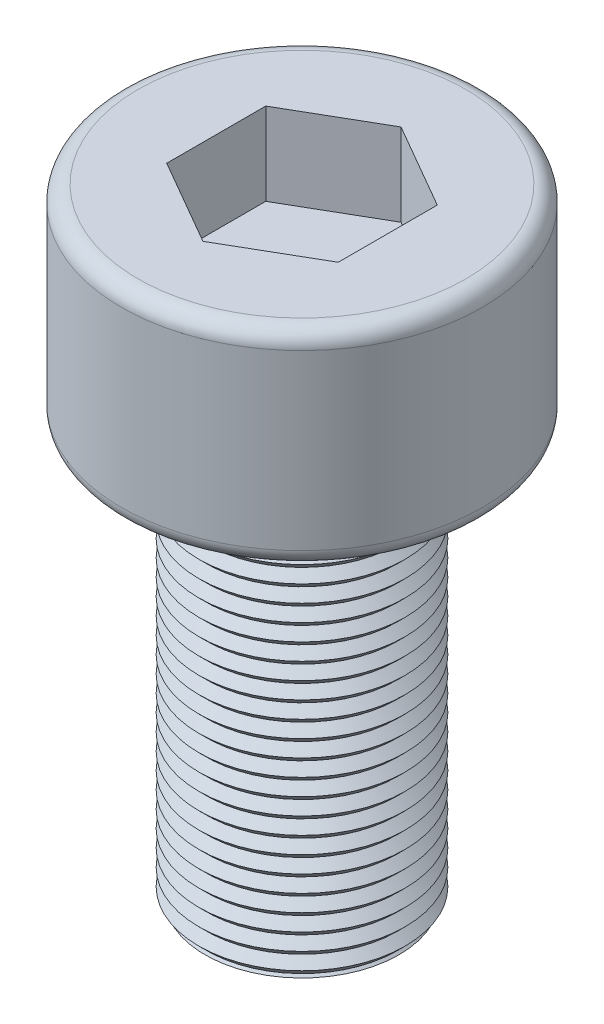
ISO-10303-21;
HEADER;
FILE_DESCRIPTION(('STEP AP214'),'2;1');
FILE_NAME('part.step','',(''),(''),'','','');
FILE_SCHEMA(('AUTOMOTIVE_DESIGN { 1 0 10303 214 1 1 1 1 }'));
ENDSEC;
DATA;
#1=APPLICATION_CONTEXT('core data for automotive mechanical design processes');
#2=APPLICATION_PROTOCOL_DEFINITION('international standard','automotive_design',2000,#1);
#3=PRODUCT_CONTEXT('',#1,'mechanical');
#4=PRODUCT('Part','Part','',(#3));
#5=PRODUCT_RELATED_PRODUCT_CATEGORY('part','',(#4));
#6=PRODUCT_DEFINITION_FORMATION('','',#4);
#7=PRODUCT_DEFINITION_CONTEXT('part definition',#1,'design');
#8=PRODUCT_DEFINITION('design','',#6,#7);
#9=PRODUCT_DEFINITION_SHAPE('','',#8);
#10=(LENGTH_UNIT() NAMED_UNIT(*) SI_UNIT(.MILLI.,.METRE.));
#11=(NAMED_UNIT(*) PLANE_ANGLE_UNIT() SI_UNIT($,.RADIAN.));
#12=(NAMED_UNIT(*) SI_UNIT($,.STERADIAN.) SOLID_ANGLE_UNIT());
#13=UNCERTAINTY_MEASURE_WITH_UNIT(LENGTH_MEASURE(1.E-05),#10,'distance_accuracy_value','');
#14=(GEOMETRIC_REPRESENTATION_CONTEXT(3) GLOBAL_UNCERTAINTY_ASSIGNED_CONTEXT((#13)) GLOBAL_UNIT_ASSIGNED_CONTEXT((#10,
#11,#12)) REPRESENTATION_CONTEXT('',''));
#15=CARTESIAN_POINT('',(0.,0.,0.));
#16=DIRECTION('',(0.,0.,1.));
#17=DIRECTION('',(1.,0.,0.));
#18=AXIS2_PLACEMENT_3D('',#15,#16,#17);
#19=CARTESIAN_POINT('',(-1.7812797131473E-12,-0.0944588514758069,0.));
#20=DIRECTION('',(-1.85174994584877E-13,-1.,0.));
#21=DIRECTION('',(1.,-1.85174994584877E-13,0.));
#22=AXIS2_PLACEMENT_3D('',#19,#20,#21);
#23=CONICAL_SURFACE('',#22,1.58749682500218,0.785398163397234);
#24=CARTESIAN_POINT('',(-1.75741270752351E-12,0.0344300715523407,0.));
#25=DIRECTION('',(1.85174994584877E-13,1.,0.));
#26=DIRECTION('',(-1.,1.85174994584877E-13,0.));
#27=AXIS2_PLACEMENT_3D('',#24,#25,#26);
#28=CIRCLE('',#27,1.45860790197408);
#29=CARTESIAN_POINT('',(-1.45860790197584,0.0344300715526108,0.));
#30=VERTEX_POINT('',#29);
#31=EDGE_CURVE('E140',#30,#30,#28,.T.);
#32=ORIENTED_EDGE('',*,*,#31,.F.);
#33=EDGE_LOOP('',(#32));
#34=FACE_BOUND('',#33,.T.);
#35=CARTESIAN_POINT('',(-1.76379064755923E-12,-1.2700000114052E-05,0.));
#36=DIRECTION('',(-1.85174994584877E-13,-1.,0.));
#37=DIRECTION('',(1.,-1.85174994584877E-13,0.));
#38=AXIS2_PLACEMENT_3D('',#35,#36,#37);
#39=CIRCLE('',#38,1.49305067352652);
#40=CARTESIAN_POINT('',(1.49305067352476,-1.27000003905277E-05,0.));
#41=VERTEX_POINT('',#40);
#42=EDGE_CURVE('E41',#41,#41,#39,.T.);
#43=ORIENTED_EDGE('',*,*,#42,.F.);
#44=EDGE_LOOP('',(#43));
#45=FACE_BOUND('',#44,.T.);
#46=ADVANCED_FACE('F37',(#34,#45),#23,.T.);
#47=CARTESIAN_POINT('',(0.,9.52498094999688,0.));
#48=DIRECTION('',(-1.85174994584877E-13,-1.,0.));
#49=DIRECTION('',(1.,-1.85174994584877E-13,0.));
#50=AXIS2_PLACEMENT_3D('',#47,#48,#49);
#51=PLANE('',#50);
#52=CARTESIAN_POINT('',(0.,9.52498094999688,0.));
#53=DIRECTION('',(-1.85174994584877E-13,-1.,0.));
#54=DIRECTION('',(1.,-1.85174994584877E-13,0.));
#55=AXIS2_PLACEMENT_3D('',#52,#53,#54);
#56=CIRCLE('',#55,2.5241194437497);
#57=CARTESIAN_POINT('',(2.5241194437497,9.52498094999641,0.));
#58=VERTEX_POINT('',#57);
#59=EDGE_CURVE('E11',#58,#58,#56,.F.);
#60=ORIENTED_EDGE('',*,*,#59,.T.);
#61=EDGE_LOOP('',(#60));
#62=FACE_BOUND('',#61,.T.);
#63=DIRECTION('',(-0.866025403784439,0.,0.5));
#64=VECTOR('',#63,1.);
#65=CARTESIAN_POINT('',(0.,9.52498094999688,-1.524));
#66=LINE('',#65,#64);
#67=CARTESIAN_POINT('',(0.,9.52498094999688,-1.524));
#68=VERTEX_POINT('',#67);
#69=CARTESIAN_POINT('',(-1.31982271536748,9.52498094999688,-0.762));
#70=VERTEX_POINT('',#69);
#71=EDGE_CURVE('E127',#68,#70,#66,.T.);
#72=ORIENTED_EDGE('',*,*,#71,.F.);
#73=DIRECTION('',(-0.866025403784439,0.,-0.5));
#74=VECTOR('',#73,1.);
#75=CARTESIAN_POINT('',(1.31982271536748,9.52498094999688,-0.762));
#76=LINE('',#75,#74);
#77=CARTESIAN_POINT('',(1.31982271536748,9.52498094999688,-0.762));
#78=VERTEX_POINT('',#77);
#79=EDGE_CURVE('E53',#78,#68,#76,.T.);
#80=ORIENTED_EDGE('',*,*,#79,.F.);
#81=DIRECTION('',(0.,0.,-1.));
#82=VECTOR('',#81,1.);
#83=CARTESIAN_POINT('',(1.31982271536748,9.52498094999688,0.762));
#84=LINE('',#83,#82);
#85=CARTESIAN_POINT('',(1.31982271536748,9.52498094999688,0.762));
#86=VERTEX_POINT('',#85);
#87=EDGE_CURVE('E136',#86,#78,#84,.T.);
#88=ORIENTED_EDGE('',*,*,#87,.F.);
#89=DIRECTION('',(0.866025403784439,0.,-0.5));
#90=VECTOR('',#89,1.);
#91=CARTESIAN_POINT('',(0.,9.52498094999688,1.524));
#92=LINE('',#91,#90);
#93=CARTESIAN_POINT('',(0.,9.52498094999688,1.524));
#94=VERTEX_POINT('',#93);
#95=EDGE_CURVE('E134',#94,#86,#92,.T.);
#96=ORIENTED_EDGE('',*,*,#95,.F.);
#97=DIRECTION('',(0.866025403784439,0.,0.5));
#98=VECTOR('',#97,1.);
#99=CARTESIAN_POINT('',(-1.31982271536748,9.52498094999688,0.762));
#100=LINE('',#99,#98);
#101=CARTESIAN_POINT('',(-1.31982271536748,9.52498094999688,0.762));
#102=VERTEX_POINT('',#101);
#103=EDGE_CURVE('E101',#102,#94,#100,.T.);
#104=ORIENTED_EDGE('',*,*,#103,.F.);
#105=DIRECTION('',(0.,0.,1.));
#106=VECTOR('',#105,1.);
#107=CARTESIAN_POINT('',(-1.31982271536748,9.52498094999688,-0.762));
#108=LINE('',#107,#106);
#109=EDGE_CURVE('E130',#70,#102,#108,.T.);
#110=ORIENTED_EDGE('',*,*,#109,.F.);
#111=EDGE_LOOP('',(#72,#80,#88,#96,#104,#110));
#112=FACE_BOUND('',#111,.T.);
#113=ADVANCED_FACE('F315',(#62,#112),#51,.F.);
#114=CARTESIAN_POINT('',(0.,9.52498094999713,0.));
#115=DIRECTION('',(1.85174994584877E-13,1.,0.));
#116=DIRECTION('',(-1.,1.85174994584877E-13,0.));
#117=AXIS2_PLACEMENT_3D('',#114,#115,#116);
#118=CYLINDRICAL_SURFACE('',#117,2.7781194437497);
#119=CARTESIAN_POINT('',(-5.40894983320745E-13,6.60398729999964,0.));
#120=DIRECTION('',(1.85174994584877E-13,1.,0.));
#121=DIRECTION('',(-1.,1.85174994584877E-13,0.));
#122=AXIS2_PLACEMENT_3D('',#119,#120,#121);
#123=CIRCLE('',#122,2.7781194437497);
#124=CARTESIAN_POINT('',(-2.77811944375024,6.60398730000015,0.));
#125=VERTEX_POINT('',#124);
#126=EDGE_CURVE('E298',#125,#125,#123,.T.);
#127=ORIENTED_EDGE('',*,*,#126,.T.);
#128=EDGE_LOOP('',(#127));
#129=FACE_BOUND('',#128,.T.);
#130=CARTESIAN_POINT('',(0.,9.27098094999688,0.));
#131=DIRECTION('',(-1.85174994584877E-13,-1.,0.));
#132=DIRECTION('',(1.,-1.85174994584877E-13,0.));
#133=AXIS2_PLACEMENT_3D('',#130,#131,#132);
#134=CIRCLE('',#133,2.7781194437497);
#135=CARTESIAN_POINT('',(2.77811944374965,9.27098094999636,0.));
#136=VERTEX_POINT('',#135);
#137=EDGE_CURVE('E295',#136,#136,#134,.T.);
#138=ORIENTED_EDGE('',*,*,#137,.T.);
#139=EDGE_LOOP('',(#138));
#140=FACE_BOUND('',#139,.T.);
#141=ADVANCED_FACE('F312',(#129,#140),#118,.T.);
#142=CARTESIAN_POINT('',(0.,6.34998729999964,0.));
#143=DIRECTION('',(1.85174994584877E-13,1.,0.));
#144=DIRECTION('',(-1.,1.85174994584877E-13,0.));
#145=AXIS2_PLACEMENT_3D('',#142,#143,#144);
#146=PLANE('',#145);
#147=CARTESIAN_POINT('',(-5.87929431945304E-13,6.34998729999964,0.));
#148=DIRECTION('',(1.85174994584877E-13,1.,0.));
#149=DIRECTION('',(-1.,1.85174994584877E-13,0.));
#150=AXIS2_PLACEMENT_3D('',#147,#148,#149);
#151=CIRCLE('',#150,2.5241194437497);
#152=CARTESIAN_POINT('',(-2.52411944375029,6.34998730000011,0.));
#153=VERTEX_POINT('',#152);
#154=EDGE_CURVE('E46',#153,#153,#151,.F.);
#155=ORIENTED_EDGE('',*,*,#154,.T.);
#156=EDGE_LOOP('',(#155));
#157=FACE_BOUND('',#156,.T.);
#158=CARTESIAN_POINT('',(-5.87929431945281E-13,6.34998729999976,0.));
#159=DIRECTION('',(1.85174994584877E-13,1.,0.));
#160=DIRECTION('',(-1.,1.85174994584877E-13,0.));
#161=AXIS2_PLACEMENT_3D('',#158,#159,#160);
#162=CIRCLE('',#161,1.45860790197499);
#163=CARTESIAN_POINT('',(-1.45860790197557,6.34998730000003,0.));
#164=VERTEX_POINT('',#163);
#165=EDGE_CURVE('E292',#164,#164,#162,.T.);
#166=ORIENTED_EDGE('',*,*,#165,.T.);
#167=EDGE_LOOP('',(#166));
#168=FACE_BOUND('',#167,.T.);
#169=ADVANCED_FACE('F304',(#157,#168),#146,.F.);
#170=CARTESIAN_POINT('',(0.,9.52498094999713,0.));
#171=DIRECTION('',(1.85174994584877E-13,1.,0.));
#172=DIRECTION('',(-1.,1.85174994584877E-13,0.));
#173=AXIS2_PLACEMENT_3D('',#170,#171,#172);
#174=CYLINDRICAL_SURFACE('',#173,1.45860790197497);
#175=ORIENTED_EDGE('',*,*,#165,.F.);
#176=EDGE_LOOP('',(#175));
#177=FACE_BOUND('',#176,.T.);
#178=CARTESIAN_POINT('',(-6.11796437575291E-13,6.22109837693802,0.));
#179=DIRECTION('',(1.85174994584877E-13,1.,0.));
#180=DIRECTION('',(-1.,1.85174994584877E-13,0.));
#181=AXIS2_PLACEMENT_3D('',#178,#179,#180);
#182=CIRCLE('',#181,1.45860790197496);
#183=CARTESIAN_POINT('',(-1.45860790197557,6.22109837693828,0.));
#184=VERTEX_POINT('',#183);
#185=EDGE_CURVE('E289',#184,#184,#182,.T.);
#186=ORIENTED_EDGE('',*,*,#185,.T.);
#187=EDGE_LOOP('',(#186));
#188=FACE_BOUND('',#187,.T.);
#189=ADVANCED_FACE('F359',(#177,#188),#174,.T.);
#190=CARTESIAN_POINT('',(-6.35663443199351E-13,6.09220945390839,0.));
#191=DIRECTION('',(-1.85174994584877E-13,-1.,0.));
#192=DIRECTION('',(1.,-1.85174994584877E-13,0.));
#193=AXIS2_PLACEMENT_3D('',#190,#191,#192);
#194=CONICAL_SURFACE('',#193,1.58749682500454,0.785398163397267);
#195=ORIENTED_EDGE('',*,*,#185,.F.);
#196=EDGE_LOOP('',(#195));
#197=FACE_BOUND('',#196,.T.);
#198=CARTESIAN_POINT('',(-6.35663443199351E-13,6.09220945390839,0.));
#199=DIRECTION('',(1.85174994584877E-13,1.,0.));
#200=DIRECTION('',(-1.,1.85174994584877E-13,0.));
#201=AXIS2_PLACEMENT_3D('',#198,#199,#200);
#202=CIRCLE('',#201,1.58749682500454);
#203=CARTESIAN_POINT('',(-1.58749682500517,6.09220945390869,0.));
#204=VERTEX_POINT('',#203);
#205=EDGE_CURVE('E286',#204,#204,#202,.T.);
#206=ORIENTED_EDGE('',*,*,#205,.T.);
#207=EDGE_LOOP('',(#206));
#208=FACE_BOUND('',#207,.T.);
#209=ADVANCED_FACE('F362',(#197,#208),#194,.T.);
#210=CARTESIAN_POINT('',(-6.59530448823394E-13,5.96332053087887,0.));
#211=DIRECTION('',(1.85174994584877E-13,1.,0.));
#212=DIRECTION('',(-1.,1.85174994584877E-13,0.));
#213=AXIS2_PLACEMENT_3D('',#210,#211,#212);
#214=CONICAL_SURFACE('',#213,1.45860790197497,0.785398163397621);
#215=ORIENTED_EDGE('',*,*,#205,.F.);
#216=EDGE_LOOP('',(#215));
#217=FACE_BOUND('',#216,.T.);
#218=CARTESIAN_POINT('',(-6.59530448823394E-13,5.96332053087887,0.));
#219=DIRECTION('',(1.85174994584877E-13,1.,0.));
#220=DIRECTION('',(-1.,1.85174994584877E-13,0.));
#221=AXIS2_PLACEMENT_3D('',#218,#219,#220);
#222=CIRCLE('',#221,1.45860790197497);
#223=CARTESIAN_POINT('',(-1.45860790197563,5.96332053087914,0.));
#224=VERTEX_POINT('',#223);
#225=EDGE_CURVE('E283',#224,#224,#222,.T.);
#226=ORIENTED_EDGE('',*,*,#225,.T.);
#227=EDGE_LOOP('',(#226));
#228=FACE_BOUND('',#227,.T.);
#229=ADVANCED_FACE('F366',(#217,#228),#214,.T.);
#230=CARTESIAN_POINT('',(-6.83397454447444E-13,5.83443160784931,0.));
#231=DIRECTION('',(-1.85174994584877E-13,-1.,0.));
#232=DIRECTION('',(1.,-1.85174994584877E-13,0.));
#233=AXIS2_PLACEMENT_3D('',#230,#231,#232);
#234=CONICAL_SURFACE('',#233,1.58749682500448,0.785398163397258);
#235=ORIENTED_EDGE('',*,*,#225,.F.);
#236=EDGE_LOOP('',(#235));
#237=FACE_BOUND('',#236,.T.);
#238=CARTESIAN_POINT('',(-6.83397454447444E-13,5.83443160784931,0.));
#239=DIRECTION('',(1.85174994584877E-13,1.,0.));
#240=DIRECTION('',(-1.,1.85174994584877E-13,0.));
#241=AXIS2_PLACEMENT_3D('',#238,#239,#240);
#242=CIRCLE('',#241,1.58749682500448);
#243=CARTESIAN_POINT('',(-1.58749682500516,5.8344316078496,0.));
#244=VERTEX_POINT('',#243);
#245=EDGE_CURVE('E280',#244,#244,#242,.T.);
#246=ORIENTED_EDGE('',*,*,#245,.T.);
#247=EDGE_LOOP('',(#246));
#248=FACE_BOUND('',#247,.T.);
#249=ADVANCED_FACE('F370',(#237,#248),#234,.T.);
#250=CARTESIAN_POINT('',(-7.07264460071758E-13,5.70554268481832,0.));
#251=DIRECTION('',(1.85174994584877E-13,1.,0.));
#252=DIRECTION('',(-1.,1.85174994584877E-13,0.));
#253=AXIS2_PLACEMENT_3D('',#250,#251,#252);
#254=CONICAL_SURFACE('',#253,1.45860790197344,0.785398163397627);
#255=ORIENTED_EDGE('',*,*,#245,.F.);
#256=EDGE_LOOP('',(#255));
#257=FACE_BOUND('',#256,.T.);
#258=CARTESIAN_POINT('',(-7.07264460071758E-13,5.70554268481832,0.));
#259=DIRECTION('',(1.85174994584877E-13,1.,0.));
#260=DIRECTION('',(-1.,1.85174994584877E-13,0.));
#261=AXIS2_PLACEMENT_3D('',#258,#259,#260);
#262=CIRCLE('',#261,1.45860790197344);
#263=CARTESIAN_POINT('',(-1.45860790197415,5.70554268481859,0.));
#264=VERTEX_POINT('',#263);
#265=EDGE_CURVE('E277',#264,#264,#262,.T.);
#266=ORIENTED_EDGE('',*,*,#265,.T.);
#267=EDGE_LOOP('',(#266));
#268=FACE_BOUND('',#267,.T.);
#269=ADVANCED_FACE('F374',(#257,#268),#254,.T.);
#270=CARTESIAN_POINT('',(-7.31131465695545E-13,5.57665376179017,0.));
#271=DIRECTION('',(-1.85174994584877E-13,-1.,0.));
#272=DIRECTION('',(1.,-1.85174994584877E-13,0.));
#273=AXIS2_PLACEMENT_3D('',#270,#271,#272);
#274=CONICAL_SURFACE('',#273,1.58749682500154,0.78539816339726);
#275=ORIENTED_EDGE('',*,*,#265,.F.);
#276=EDGE_LOOP('',(#275));
#277=FACE_BOUND('',#276,.T.);
#278=CARTESIAN_POINT('',(-7.31131465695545E-13,5.57665376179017,0.));
#279=DIRECTION('',(1.85174994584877E-13,1.,0.));
#280=DIRECTION('',(-1.,1.85174994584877E-13,0.));
#281=AXIS2_PLACEMENT_3D('',#278,#279,#280);
#282=CIRCLE('',#281,1.58749682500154);
#283=CARTESIAN_POINT('',(-1.58749682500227,5.57665376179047,0.));
#284=VERTEX_POINT('',#283);
#285=EDGE_CURVE('E274',#284,#284,#282,.T.);
#286=ORIENTED_EDGE('',*,*,#285,.T.);
#287=EDGE_LOOP('',(#286));
#288=FACE_BOUND('',#287,.T.);
#289=ADVANCED_FACE('F378',(#277,#288),#274,.T.);
#290=CARTESIAN_POINT('',(-7.54998471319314E-13,5.44776483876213,0.));
#291=DIRECTION('',(1.85174994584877E-13,1.,0.));
#292=DIRECTION('',(-1.,1.85174994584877E-13,0.));
#293=AXIS2_PLACEMENT_3D('',#290,#291,#292);
#294=CONICAL_SURFACE('',#293,1.45860790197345,0.78539816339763);
#295=ORIENTED_EDGE('',*,*,#285,.F.);
#296=EDGE_LOOP('',(#295));
#297=FACE_BOUND('',#296,.T.);
#298=CARTESIAN_POINT('',(-7.54998471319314E-13,5.44776483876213,0.));
#299=DIRECTION('',(1.85174994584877E-13,1.,0.));
#300=DIRECTION('',(-1.,1.85174994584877E-13,0.));
#301=AXIS2_PLACEMENT_3D('',#298,#299,#300);
#302=CIRCLE('',#301,1.45860790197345);
#303=CARTESIAN_POINT('',(-1.4586079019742,5.4477648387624,0.));
#304=VERTEX_POINT('',#303);
#305=EDGE_CURVE('E271',#304,#304,#302,.T.);
#306=ORIENTED_EDGE('',*,*,#305,.T.);
#307=EDGE_LOOP('',(#306));
#308=FACE_BOUND('',#307,.T.);
#309=ADVANCED_FACE('F382',(#297,#308),#294,.T.);
#310=CARTESIAN_POINT('',(-7.78865476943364E-13,5.31887591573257,0.));
#311=DIRECTION('',(-1.85174994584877E-13,-1.,0.));
#312=DIRECTION('',(1.,-1.85174994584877E-13,0.));
#313=AXIS2_PLACEMENT_3D('',#310,#311,#312);
#314=CONICAL_SURFACE('',#313,1.58749682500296,0.785398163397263);
#315=ORIENTED_EDGE('',*,*,#305,.F.);
#316=EDGE_LOOP('',(#315));
#317=FACE_BOUND('',#316,.T.);
#318=CARTESIAN_POINT('',(-7.78865476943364E-13,5.31887591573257,0.));
#319=DIRECTION('',(1.85174994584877E-13,1.,0.));
#320=DIRECTION('',(-1.,1.85174994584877E-13,0.));
#321=AXIS2_PLACEMENT_3D('',#318,#319,#320);
#322=CIRCLE('',#321,1.58749682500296);
#323=CARTESIAN_POINT('',(-1.58749682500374,5.31887591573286,0.));
#324=VERTEX_POINT('',#323);
#325=EDGE_CURVE('E268',#324,#324,#322,.T.);
#326=ORIENTED_EDGE('',*,*,#325,.T.);
#327=EDGE_LOOP('',(#326));
#328=FACE_BOUND('',#327,.T.);
#329=ADVANCED_FACE('F386',(#317,#328),#314,.T.);
#330=CARTESIAN_POINT('',(-8.02732482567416E-13,5.18998699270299,0.));
#331=DIRECTION('',(1.85174994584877E-13,1.,0.));
#332=DIRECTION('',(-1.,1.85174994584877E-13,0.));
#333=AXIS2_PLACEMENT_3D('',#330,#331,#332);
#334=CONICAL_SURFACE('',#333,1.45860790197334,0.785398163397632);
#335=ORIENTED_EDGE('',*,*,#325,.F.);
#336=EDGE_LOOP('',(#335));
#337=FACE_BOUND('',#336,.T.);
#338=CARTESIAN_POINT('',(-8.02732482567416E-13,5.18998699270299,0.));
#339=DIRECTION('',(1.85174994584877E-13,1.,0.));
#340=DIRECTION('',(-1.,1.85174994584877E-13,0.));
#341=AXIS2_PLACEMENT_3D('',#338,#339,#340);
#342=CIRCLE('',#341,1.45860790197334);
#343=CARTESIAN_POINT('',(-1.45860790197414,5.18998699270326,0.));
#344=VERTEX_POINT('',#343);
#345=EDGE_CURVE('E265',#344,#344,#342,.T.);
#346=ORIENTED_EDGE('',*,*,#345,.T.);
#347=EDGE_LOOP('',(#346));
#348=FACE_BOUND('',#347,.T.);
#349=ADVANCED_FACE('F390',(#337,#348),#334,.T.);
#350=CARTESIAN_POINT('',(-8.26599488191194E-13,5.0610980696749,0.));
#351=DIRECTION('',(-1.85174994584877E-13,-1.,0.));
#352=DIRECTION('',(1.,-1.85174994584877E-13,0.));
#353=AXIS2_PLACEMENT_3D('',#350,#351,#352);
#354=CONICAL_SURFACE('',#353,1.58749682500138,0.785398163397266);
#355=ORIENTED_EDGE('',*,*,#345,.F.);
#356=EDGE_LOOP('',(#355));
#357=FACE_BOUND('',#356,.T.);
#358=CARTESIAN_POINT('',(-8.26599488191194E-13,5.0610980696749,0.));
#359=DIRECTION('',(1.85174994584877E-13,1.,0.));
#360=DIRECTION('',(-1.,1.85174994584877E-13,0.));
#361=AXIS2_PLACEMENT_3D('',#358,#359,#360);
#362=CIRCLE('',#361,1.58749682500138);
#363=CARTESIAN_POINT('',(-1.58749682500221,5.06109806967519,0.));
#364=VERTEX_POINT('',#363);
#365=EDGE_CURVE('E262',#364,#364,#362,.T.);
#366=ORIENTED_EDGE('',*,*,#365,.T.);
#367=EDGE_LOOP('',(#366));
#368=FACE_BOUND('',#367,.T.);
#369=ADVANCED_FACE('F394',(#357,#368),#354,.T.);
#370=CARTESIAN_POINT('',(-8.50466493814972E-13,4.9322091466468,0.));
#371=DIRECTION('',(1.85174994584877E-13,1.,0.));
#372=DIRECTION('',(-1.,1.85174994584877E-13,0.));
#373=AXIS2_PLACEMENT_3D('',#370,#371,#372);
#374=CONICAL_SURFACE('',#373,1.45860790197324,0.78539816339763);
#375=ORIENTED_EDGE('',*,*,#365,.F.);
#376=EDGE_LOOP('',(#375));
#377=FACE_BOUND('',#376,.T.);
#378=CARTESIAN_POINT('',(-8.50466493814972E-13,4.9322091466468,0.));
#379=DIRECTION('',(1.85174994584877E-13,1.,0.));
#380=DIRECTION('',(-1.,1.85174994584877E-13,0.));
#381=AXIS2_PLACEMENT_3D('',#378,#379,#380);
#382=CIRCLE('',#381,1.45860790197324);
#383=CARTESIAN_POINT('',(-1.45860790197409,4.93220914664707,0.));
#384=VERTEX_POINT('',#383);
#385=EDGE_CURVE('E259',#384,#384,#382,.T.);
#386=ORIENTED_EDGE('',*,*,#385,.T.);
#387=EDGE_LOOP('',(#386));
#388=FACE_BOUND('',#387,.T.);
#389=ADVANCED_FACE('F398',(#377,#388),#374,.T.);
#390=CARTESIAN_POINT('',(-8.74333499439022E-13,4.80332022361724,0.));
#391=DIRECTION('',(-1.85174994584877E-13,-1.,0.));
#392=DIRECTION('',(1.,-1.85174994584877E-13,0.));
#393=AXIS2_PLACEMENT_3D('',#390,#391,#392);
#394=CONICAL_SURFACE('',#393,1.58749682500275,0.785398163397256);
#395=ORIENTED_EDGE('',*,*,#385,.F.);
#396=EDGE_LOOP('',(#395));
#397=FACE_BOUND('',#396,.T.);
#398=CARTESIAN_POINT('',(-8.74333499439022E-13,4.80332022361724,0.));
#399=DIRECTION('',(1.85174994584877E-13,1.,0.));
#400=DIRECTION('',(-1.,1.85174994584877E-13,0.));
#401=AXIS2_PLACEMENT_3D('',#398,#399,#400);
#402=CIRCLE('',#401,1.58749682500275);
#403=CARTESIAN_POINT('',(-1.58749682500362,4.80332022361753,0.));
#404=VERTEX_POINT('',#403);
#405=EDGE_CURVE('E256',#404,#404,#402,.T.);
#406=ORIENTED_EDGE('',*,*,#405,.T.);
#407=EDGE_LOOP('',(#406));
#408=FACE_BOUND('',#407,.T.);
#409=ADVANCED_FACE('F402',(#397,#408),#394,.T.);
#410=CARTESIAN_POINT('',(-8.98200505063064E-13,4.67443130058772,0.));
#411=DIRECTION('',(1.85174994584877E-13,1.,0.));
#412=DIRECTION('',(-1.,1.85174994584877E-13,0.));
#413=AXIS2_PLACEMENT_3D('',#410,#411,#412);
#414=CONICAL_SURFACE('',#413,1.45860790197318,0.785398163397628);
#415=ORIENTED_EDGE('',*,*,#405,.F.);
#416=EDGE_LOOP('',(#415));
#417=FACE_BOUND('',#416,.T.);
#418=CARTESIAN_POINT('',(-8.98200505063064E-13,4.67443130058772,0.));
#419=DIRECTION('',(1.85174994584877E-13,1.,0.));
#420=DIRECTION('',(-1.,1.85174994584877E-13,0.));
#421=AXIS2_PLACEMENT_3D('',#418,#419,#420);
#422=CIRCLE('',#421,1.45860790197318);
#423=CARTESIAN_POINT('',(-1.45860790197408,4.67443130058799,0.));
#424=VERTEX_POINT('',#423);
#425=EDGE_CURVE('E253',#424,#424,#422,.T.);
#426=ORIENTED_EDGE('',*,*,#425,.T.);
#427=EDGE_LOOP('',(#426));
#428=FACE_BOUND('',#427,.T.);
#429=ADVANCED_FACE('F406',(#417,#428),#414,.T.);
#430=CARTESIAN_POINT('',(-9.22067510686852E-13,4.54554237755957,0.));
#431=DIRECTION('',(-1.85174994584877E-13,-1.,0.));
#432=DIRECTION('',(1.,-1.85174994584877E-13,0.));
#433=AXIS2_PLACEMENT_3D('',#430,#431,#432);
#434=CONICAL_SURFACE('',#433,1.58749682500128,0.785398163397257);
#435=ORIENTED_EDGE('',*,*,#425,.F.);
#436=EDGE_LOOP('',(#435));
#437=FACE_BOUND('',#436,.T.);
#438=CARTESIAN_POINT('',(-9.22067510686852E-13,4.54554237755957,0.));
#439=DIRECTION('',(1.85174994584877E-13,1.,0.));
#440=DIRECTION('',(-1.,1.85174994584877E-13,0.));
#441=AXIS2_PLACEMENT_3D('',#438,#439,#440);
#442=CIRCLE('',#441,1.58749682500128);
#443=CARTESIAN_POINT('',(-1.5874968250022,4.54554237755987,0.));
#444=VERTEX_POINT('',#443);
#445=EDGE_CURVE('E250',#444,#444,#442,.T.);
#446=ORIENTED_EDGE('',*,*,#445,.T.);
#447=EDGE_LOOP('',(#446));
#448=FACE_BOUND('',#447,.T.);
#449=ADVANCED_FACE('F410',(#437,#448),#434,.T.);
#450=CARTESIAN_POINT('',(-9.45934516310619E-13,4.41665345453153,0.));
#451=DIRECTION('',(1.85174994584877E-13,1.,0.));
#452=DIRECTION('',(-1.,1.85174994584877E-13,0.));
#453=AXIS2_PLACEMENT_3D('',#450,#451,#452);
#454=CONICAL_SURFACE('',#453,1.45860790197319,0.785398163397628);
#455=ORIENTED_EDGE('',*,*,#445,.F.);
#456=EDGE_LOOP('',(#455));
#457=FACE_BOUND('',#456,.T.);
#458=CARTESIAN_POINT('',(-9.45934516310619E-13,4.41665345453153,0.));
#459=DIRECTION('',(1.85174994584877E-13,1.,0.));
#460=DIRECTION('',(-1.,1.85174994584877E-13,0.));
#461=AXIS2_PLACEMENT_3D('',#458,#459,#460);
#462=CIRCLE('',#461,1.45860790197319);
#463=CARTESIAN_POINT('',(-1.45860790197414,4.4166534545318,0.));
#464=VERTEX_POINT('',#463);
#465=EDGE_CURVE('E247',#464,#464,#462,.T.);
#466=ORIENTED_EDGE('',*,*,#465,.T.);
#467=EDGE_LOOP('',(#466));
#468=FACE_BOUND('',#467,.T.);
#469=ADVANCED_FACE('F414',(#457,#468),#454,.T.);
#470=CARTESIAN_POINT('',(-9.6980152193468E-13,4.28776453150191,0.));
#471=DIRECTION('',(-1.85174994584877E-13,-1.,0.));
#472=DIRECTION('',(1.,-1.85174994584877E-13,0.));
#473=AXIS2_PLACEMENT_3D('',#470,#471,#472);
#474=CONICAL_SURFACE('',#473,1.58749682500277,0.785398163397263);
#475=ORIENTED_EDGE('',*,*,#465,.F.);
#476=EDGE_LOOP('',(#475));
#477=FACE_BOUND('',#476,.T.);
#478=CARTESIAN_POINT('',(-9.6980152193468E-13,4.28776453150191,0.));
#479=DIRECTION('',(1.85174994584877E-13,1.,0.));
#480=DIRECTION('',(-1.,1.85174994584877E-13,0.));
#481=AXIS2_PLACEMENT_3D('',#478,#479,#480);
#482=CIRCLE('',#481,1.58749682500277);
#483=CARTESIAN_POINT('',(-1.58749682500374,4.28776453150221,0.));
#484=VERTEX_POINT('',#483);
#485=EDGE_CURVE('E244',#484,#484,#482,.T.);
#486=ORIENTED_EDGE('',*,*,#485,.T.);
#487=EDGE_LOOP('',(#486));
#488=FACE_BOUND('',#487,.T.);
#489=ADVANCED_FACE('F418',(#477,#488),#474,.T.);
#490=CARTESIAN_POINT('',(-9.93668527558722E-13,4.15887560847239,0.));
#491=DIRECTION('',(1.85174994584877E-13,1.,0.));
#492=DIRECTION('',(-1.,1.85174994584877E-13,0.));
#493=AXIS2_PLACEMENT_3D('',#490,#491,#492);
#494=CONICAL_SURFACE('',#493,1.4586079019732,0.785398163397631);
#495=ORIENTED_EDGE('',*,*,#485,.F.);
#496=EDGE_LOOP('',(#495));
#497=FACE_BOUND('',#496,.T.);
#498=CARTESIAN_POINT('',(-9.93668527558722E-13,4.15887560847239,0.));
#499=DIRECTION('',(1.85174994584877E-13,1.,0.));
#500=DIRECTION('',(-1.,1.85174994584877E-13,0.));
#501=AXIS2_PLACEMENT_3D('',#498,#499,#500);
#502=CIRCLE('',#501,1.4586079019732);
#503=CARTESIAN_POINT('',(-1.45860790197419,4.15887560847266,0.));
#504=VERTEX_POINT('',#503);
#505=EDGE_CURVE('E241',#504,#504,#502,.T.);
#506=ORIENTED_EDGE('',*,*,#505,.T.);
#507=EDGE_LOOP('',(#506));
#508=FACE_BOUND('',#507,.T.);
#509=ADVANCED_FACE('F422',(#497,#508),#494,.T.);
#510=CARTESIAN_POINT('',(-1.0175355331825E-12,4.0299866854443,0.));
#511=DIRECTION('',(-1.85174994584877E-13,-1.,0.));
#512=DIRECTION('',(1.,-1.85174994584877E-13,0.));
#513=AXIS2_PLACEMENT_3D('',#510,#511,#512);
#514=CONICAL_SURFACE('',#513,1.58749682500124,0.785398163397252);
#515=ORIENTED_EDGE('',*,*,#505,.F.);
#516=EDGE_LOOP('',(#515));
#517=FACE_BOUND('',#516,.T.);
#518=CARTESIAN_POINT('',(-1.0175355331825E-12,4.0299866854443,0.));
#519=DIRECTION('',(1.85174994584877E-13,1.,0.));
#520=DIRECTION('',(-1.,1.85174994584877E-13,0.));
#521=AXIS2_PLACEMENT_3D('',#518,#519,#520);
#522=CIRCLE('',#521,1.58749682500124);
#523=CARTESIAN_POINT('',(-1.58749682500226,4.0299866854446,0.));
#524=VERTEX_POINT('',#523);
#525=EDGE_CURVE('E238',#524,#524,#522,.T.);
#526=ORIENTED_EDGE('',*,*,#525,.T.);
#527=EDGE_LOOP('',(#526));
#528=FACE_BOUND('',#527,.T.);
#529=ADVANCED_FACE('F426',(#517,#528),#514,.T.);
#530=CARTESIAN_POINT('',(-1.04140253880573E-12,3.90109776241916,0.));
#531=DIRECTION('',(1.85174994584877E-13,1.,0.));
#532=DIRECTION('',(-1.,1.85174994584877E-13,0.));
#533=AXIS2_PLACEMENT_3D('',#530,#531,#532);
#534=CONICAL_SURFACE('',#533,1.45860790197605,0.785398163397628);
#535=ORIENTED_EDGE('',*,*,#525,.F.);
#536=EDGE_LOOP('',(#535));
#537=FACE_BOUND('',#536,.T.);
#538=CARTESIAN_POINT('',(-1.04140253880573E-12,3.90109776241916,0.));
#539=DIRECTION('',(1.85174994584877E-13,1.,0.));
#540=DIRECTION('',(-1.,1.85174994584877E-13,0.));
#541=AXIS2_PLACEMENT_3D('',#538,#539,#540);
#542=CIRCLE('',#541,1.45860790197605);
#543=CARTESIAN_POINT('',(-1.45860790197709,3.90109776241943,0.));
#544=VERTEX_POINT('',#543);
#545=EDGE_CURVE('E235',#544,#544,#542,.T.);
#546=ORIENTED_EDGE('',*,*,#545,.T.);
#547=EDGE_LOOP('',(#546));
#548=FACE_BOUND('',#547,.T.);
#549=ADVANCED_FACE('F430',(#537,#548),#534,.T.);
#550=CARTESIAN_POINT('',(-1.06526954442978E-12,3.77220883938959,0.));
#551=DIRECTION('',(-1.85174994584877E-13,-1.,0.));
#552=DIRECTION('',(1.,-1.85174994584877E-13,0.));
#553=AXIS2_PLACEMENT_3D('',#550,#551,#552);
#554=CONICAL_SURFACE('',#553,1.58749682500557,0.785398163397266);
#555=ORIENTED_EDGE('',*,*,#545,.F.);
#556=EDGE_LOOP('',(#555));
#557=FACE_BOUND('',#556,.T.);
#558=CARTESIAN_POINT('',(-1.06526954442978E-12,3.77220883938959,0.));
#559=DIRECTION('',(1.85174994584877E-13,1.,0.));
#560=DIRECTION('',(-1.,1.85174994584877E-13,0.));
#561=AXIS2_PLACEMENT_3D('',#558,#559,#560);
#562=CIRCLE('',#561,1.58749682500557);
#563=CARTESIAN_POINT('',(-1.58749682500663,3.77220883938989,0.));
#564=VERTEX_POINT('',#563);
#565=EDGE_CURVE('E232',#564,#564,#562,.T.);
#566=ORIENTED_EDGE('',*,*,#565,.T.);
#567=EDGE_LOOP('',(#566));
#568=FACE_BOUND('',#567,.T.);
#569=ADVANCED_FACE('F434',(#557,#568),#554,.T.);
#570=CARTESIAN_POINT('',(-1.08913655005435E-12,3.64331991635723,0.));
#571=DIRECTION('',(1.85174994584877E-13,1.,0.));
#572=DIRECTION('',(-1.,1.85174994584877E-13,0.));
#573=AXIS2_PLACEMENT_3D('',#570,#571,#572);
#574=CONICAL_SURFACE('',#573,1.45860790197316,0.785398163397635);
#575=ORIENTED_EDGE('',*,*,#565,.F.);
#576=EDGE_LOOP('',(#575));
#577=FACE_BOUND('',#576,.T.);
#578=CARTESIAN_POINT('',(-1.08913655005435E-12,3.64331991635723,0.));
#579=DIRECTION('',(1.85174994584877E-13,1.,0.));
#580=DIRECTION('',(-1.,1.85174994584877E-13,0.));
#581=AXIS2_PLACEMENT_3D('',#578,#579,#580);
#582=CIRCLE('',#581,1.45860790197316);
#583=CARTESIAN_POINT('',(-1.45860790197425,3.6433199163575,0.));
#584=VERTEX_POINT('',#583);
#585=EDGE_CURVE('E229',#584,#584,#582,.T.);
#586=ORIENTED_EDGE('',*,*,#585,.T.);
#587=EDGE_LOOP('',(#586));
#588=FACE_BOUND('',#587,.T.);
#589=ADVANCED_FACE('F438',(#577,#588),#574,.T.);
#590=CARTESIAN_POINT('',(-1.11300355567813E-12,3.51443099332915,0.));
#591=DIRECTION('',(-1.85174994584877E-13,-1.,0.));
#592=DIRECTION('',(1.,-1.85174994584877E-13,0.));
#593=AXIS2_PLACEMENT_3D('',#590,#591,#592);
#594=CONICAL_SURFACE('',#593,1.5874968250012,0.785398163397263);
#595=ORIENTED_EDGE('',*,*,#585,.F.);
#596=EDGE_LOOP('',(#595));
#597=FACE_BOUND('',#596,.T.);
#598=CARTESIAN_POINT('',(-1.11300355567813E-12,3.51443099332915,0.));
#599=DIRECTION('',(1.85174994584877E-13,1.,0.));
#600=DIRECTION('',(-1.,1.85174994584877E-13,0.));
#601=AXIS2_PLACEMENT_3D('',#598,#599,#600);
#602=CIRCLE('',#601,1.5874968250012);
#603=CARTESIAN_POINT('',(-1.58749682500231,3.51443099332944,0.));
#604=VERTEX_POINT('',#603);
#605=EDGE_CURVE('E226',#604,#604,#602,.T.);
#606=ORIENTED_EDGE('',*,*,#605,.T.);
#607=EDGE_LOOP('',(#606));
#608=FACE_BOUND('',#607,.T.);
#609=ADVANCED_FACE('F442',(#597,#608),#594,.T.);
#610=CARTESIAN_POINT('',(-1.13687056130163E-12,3.38554207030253,0.));
#611=DIRECTION('',(1.85174994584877E-13,1.,0.));
#612=DIRECTION('',(-1.,1.85174994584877E-13,0.));
#613=AXIS2_PLACEMENT_3D('',#610,#611,#612);
#614=CONICAL_SURFACE('',#613,1.45860790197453,0.785398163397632);
#615=ORIENTED_EDGE('',*,*,#605,.F.);
#616=EDGE_LOOP('',(#615));
#617=FACE_BOUND('',#616,.T.);
#618=CARTESIAN_POINT('',(-1.13687056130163E-12,3.38554207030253,0.));
#619=DIRECTION('',(1.85174994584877E-13,1.,0.));
#620=DIRECTION('',(-1.,1.85174994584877E-13,0.));
#621=AXIS2_PLACEMENT_3D('',#618,#619,#620);
#622=CIRCLE('',#621,1.45860790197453);
#623=CARTESIAN_POINT('',(-1.45860790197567,3.3855420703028,0.));
#624=VERTEX_POINT('',#623);
#625=EDGE_CURVE('E223',#624,#624,#622,.T.);
#626=ORIENTED_EDGE('',*,*,#625,.T.);
#627=EDGE_LOOP('',(#626));
#628=FACE_BOUND('',#627,.T.);
#629=ADVANCED_FACE('F446',(#617,#628),#614,.T.);
#630=CARTESIAN_POINT('',(-1.16073756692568E-12,3.25665314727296,0.));
#631=DIRECTION('',(-1.85174994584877E-13,-1.,0.));
#632=DIRECTION('',(1.,-1.85174994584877E-13,0.));
#633=AXIS2_PLACEMENT_3D('',#630,#631,#632);
#634=CONICAL_SURFACE('',#633,1.58749682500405,0.785398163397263);
#635=ORIENTED_EDGE('',*,*,#625,.F.);
#636=EDGE_LOOP('',(#635));
#637=FACE_BOUND('',#636,.T.);
#638=CARTESIAN_POINT('',(-1.16073756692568E-12,3.25665314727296,0.));
#639=DIRECTION('',(1.85174994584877E-13,1.,0.));
#640=DIRECTION('',(-1.,1.85174994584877E-13,0.));
#641=AXIS2_PLACEMENT_3D('',#638,#639,#640);
#642=CIRCLE('',#641,1.58749682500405);
#643=CARTESIAN_POINT('',(-1.58749682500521,3.25665314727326,0.));
#644=VERTEX_POINT('',#643);
#645=EDGE_CURVE('E220',#644,#644,#642,.T.);
#646=ORIENTED_EDGE('',*,*,#645,.T.);
#647=EDGE_LOOP('',(#646));
#648=FACE_BOUND('',#647,.T.);
#649=ADVANCED_FACE('F450',(#637,#648),#634,.T.);
#650=CARTESIAN_POINT('',(-1.18460457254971E-12,3.1277642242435,0.));
#651=DIRECTION('',(1.85174994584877E-13,1.,0.));
#652=DIRECTION('',(-1.,1.85174994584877E-13,0.));
#653=AXIS2_PLACEMENT_3D('',#650,#651,#652);
#654=CONICAL_SURFACE('',#653,1.45860790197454,0.785398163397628);
#655=ORIENTED_EDGE('',*,*,#645,.F.);
#656=EDGE_LOOP('',(#655));
#657=FACE_BOUND('',#656,.T.);
#658=CARTESIAN_POINT('',(-1.18460457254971E-12,3.1277642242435,0.));
#659=DIRECTION('',(1.85174994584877E-13,1.,0.));
#660=DIRECTION('',(-1.,1.85174994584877E-13,0.));
#661=AXIS2_PLACEMENT_3D('',#658,#659,#660);
#662=CIRCLE('',#661,1.45860790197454);
#663=CARTESIAN_POINT('',(-1.45860790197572,3.12776422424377,0.));
#664=VERTEX_POINT('',#663);
#665=EDGE_CURVE('E217',#664,#664,#662,.T.);
#666=ORIENTED_EDGE('',*,*,#665,.T.);
#667=EDGE_LOOP('',(#666));
#668=FACE_BOUND('',#667,.T.);
#669=ADVANCED_FACE('F454',(#657,#668),#654,.T.);
#670=CARTESIAN_POINT('',(-1.2084715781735E-12,2.99887530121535,0.));
#671=DIRECTION('',(-1.85174994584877E-13,-1.,0.));
#672=DIRECTION('',(1.,-1.85174994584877E-13,0.));
#673=AXIS2_PLACEMENT_3D('',#670,#671,#672);
#674=CONICAL_SURFACE('',#673,1.58749682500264,0.785398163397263);
#675=ORIENTED_EDGE('',*,*,#665,.F.);
#676=EDGE_LOOP('',(#675));
#677=FACE_BOUND('',#676,.T.);
#678=CARTESIAN_POINT('',(-1.2084715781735E-12,2.99887530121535,0.));
#679=DIRECTION('',(1.85174994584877E-13,1.,0.));
#680=DIRECTION('',(-1.,1.85174994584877E-13,0.));
#681=AXIS2_PLACEMENT_3D('',#678,#679,#680);
#682=CIRCLE('',#681,1.58749682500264);
#683=CARTESIAN_POINT('',(-1.58749682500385,2.99887530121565,0.));
#684=VERTEX_POINT('',#683);
#685=EDGE_CURVE('E214',#684,#684,#682,.T.);
#686=ORIENTED_EDGE('',*,*,#685,.T.);
#687=EDGE_LOOP('',(#686));
#688=FACE_BOUND('',#687,.T.);
#689=ADVANCED_FACE('F458',(#677,#688),#674,.T.);
#690=CARTESIAN_POINT('',(-1.23233858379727E-12,2.86998637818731,0.));
#691=DIRECTION('',(1.85174994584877E-13,1.,0.));
#692=DIRECTION('',(-1.,1.85174994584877E-13,0.));
#693=AXIS2_PLACEMENT_3D('',#690,#691,#692);
#694=CONICAL_SURFACE('',#693,1.45860790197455,0.785398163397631);
#695=ORIENTED_EDGE('',*,*,#685,.F.);
#696=EDGE_LOOP('',(#695));
#697=FACE_BOUND('',#696,.T.);
#698=CARTESIAN_POINT('',(-1.23233858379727E-12,2.86998637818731,0.));
#699=DIRECTION('',(1.85174994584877E-13,1.,0.));
#700=DIRECTION('',(-1.,1.85174994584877E-13,0.));
#701=AXIS2_PLACEMENT_3D('',#698,#699,#700);
#702=CIRCLE('',#701,1.45860790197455);
#703=CARTESIAN_POINT('',(-1.45860790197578,2.86998637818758,0.));
#704=VERTEX_POINT('',#703);
#705=EDGE_CURVE('E211',#704,#704,#702,.T.);
#706=ORIENTED_EDGE('',*,*,#705,.T.);
#707=EDGE_LOOP('',(#706));
#708=FACE_BOUND('',#707,.T.);
#709=ADVANCED_FACE('F462',(#697,#708),#694,.T.);
#710=CARTESIAN_POINT('',(-1.25620558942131E-12,2.74109745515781,0.));
#711=DIRECTION('',(-1.85174994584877E-13,-1.,0.));
#712=DIRECTION('',(1.,-1.85174994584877E-13,0.));
#713=AXIS2_PLACEMENT_3D('',#710,#711,#712);
#714=CONICAL_SURFACE('',#713,1.58749682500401,0.785398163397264);
#715=ORIENTED_EDGE('',*,*,#705,.F.);
#716=EDGE_LOOP('',(#715));
#717=FACE_BOUND('',#716,.T.);
#718=CARTESIAN_POINT('',(-1.25620558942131E-12,2.74109745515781,0.));
#719=DIRECTION('',(1.85174994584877E-13,1.,0.));
#720=DIRECTION('',(-1.,1.85174994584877E-13,0.));
#721=AXIS2_PLACEMENT_3D('',#718,#719,#720);
#722=CIRCLE('',#721,1.58749682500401);
#723=CARTESIAN_POINT('',(-1.58749682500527,2.7410974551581,0.));
#724=VERTEX_POINT('',#723);
#725=EDGE_CURVE('E208',#724,#724,#722,.T.);
#726=ORIENTED_EDGE('',*,*,#725,.T.);
#727=EDGE_LOOP('',(#726));
#728=FACE_BOUND('',#727,.T.);
#729=ADVANCED_FACE('F466',(#717,#728),#714,.T.);
#730=CARTESIAN_POINT('',(-1.28007259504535E-12,2.61220853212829,0.));
#731=DIRECTION('',(1.85174994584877E-13,1.,0.));
#732=DIRECTION('',(-1.,1.85174994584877E-13,0.));
#733=AXIS2_PLACEMENT_3D('',#730,#731,#732);
#734=CONICAL_SURFACE('',#733,1.45860790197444,0.785398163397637);
#735=ORIENTED_EDGE('',*,*,#725,.F.);
#736=EDGE_LOOP('',(#735));
#737=FACE_BOUND('',#736,.T.);
#738=CARTESIAN_POINT('',(-1.28007259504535E-12,2.61220853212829,0.));
#739=DIRECTION('',(1.85174994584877E-13,1.,0.));
#740=DIRECTION('',(-1.,1.85174994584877E-13,0.));
#741=AXIS2_PLACEMENT_3D('',#738,#739,#740);
#742=CIRCLE('',#741,1.45860790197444);
#743=CARTESIAN_POINT('',(-1.45860790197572,2.61220853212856,0.));
#744=VERTEX_POINT('',#743);
#745=EDGE_CURVE('E205',#744,#744,#742,.T.);
#746=ORIENTED_EDGE('',*,*,#745,.T.);
#747=EDGE_LOOP('',(#746));
#748=FACE_BOUND('',#747,.T.);
#749=ADVANCED_FACE('F470',(#737,#748),#734,.T.);
#750=CARTESIAN_POINT('',(-1.30393960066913E-12,2.4833196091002,0.));
#751=DIRECTION('',(-1.85174994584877E-13,-1.,0.));
#752=DIRECTION('',(1.,-1.85174994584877E-13,0.));
#753=AXIS2_PLACEMENT_3D('',#750,#751,#752);
#754=CONICAL_SURFACE('',#753,1.58749682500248,0.785398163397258);
#755=ORIENTED_EDGE('',*,*,#745,.F.);
#756=EDGE_LOOP('',(#755));
#757=FACE_BOUND('',#756,.T.);
#758=CARTESIAN_POINT('',(-1.30393960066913E-12,2.4833196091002,0.));
#759=DIRECTION('',(1.85174994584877E-13,1.,0.));
#760=DIRECTION('',(-1.,1.85174994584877E-13,0.));
#761=AXIS2_PLACEMENT_3D('',#758,#759,#760);
#762=CIRCLE('',#761,1.58749682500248);
#763=CARTESIAN_POINT('',(-1.58749682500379,2.48331960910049,0.));
#764=VERTEX_POINT('',#763);
#765=EDGE_CURVE('E202',#764,#764,#762,.T.);
#766=ORIENTED_EDGE('',*,*,#765,.T.);
#767=EDGE_LOOP('',(#766));
#768=FACE_BOUND('',#767,.T.);
#769=ADVANCED_FACE('F474',(#757,#768),#754,.T.);
#770=CARTESIAN_POINT('',(-1.3278066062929E-12,2.3544306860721,0.));
#771=DIRECTION('',(1.85174994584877E-13,1.,0.));
#772=DIRECTION('',(-1.,1.85174994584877E-13,0.));
#773=AXIS2_PLACEMENT_3D('',#770,#771,#772);
#774=CONICAL_SURFACE('',#773,1.45860790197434,0.785398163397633);
#775=ORIENTED_EDGE('',*,*,#765,.F.);
#776=EDGE_LOOP('',(#775));
#777=FACE_BOUND('',#776,.T.);
#778=CARTESIAN_POINT('',(-1.3278066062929E-12,2.3544306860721,0.));
#779=DIRECTION('',(1.85174994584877E-13,1.,0.));
#780=DIRECTION('',(-1.,1.85174994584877E-13,0.));
#781=AXIS2_PLACEMENT_3D('',#778,#779,#780);
#782=CIRCLE('',#781,1.45860790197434);
#783=CARTESIAN_POINT('',(-1.45860790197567,2.35443068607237,0.));
#784=VERTEX_POINT('',#783);
#785=EDGE_CURVE('E199',#784,#784,#782,.T.);
#786=ORIENTED_EDGE('',*,*,#785,.T.);
#787=EDGE_LOOP('',(#786));
#788=FACE_BOUND('',#787,.T.);
#789=ADVANCED_FACE('F478',(#777,#788),#774,.T.);
#790=CARTESIAN_POINT('',(-1.35167361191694E-12,2.22554176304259,0.));
#791=DIRECTION('',(-1.85174994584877E-13,-1.,0.));
#792=DIRECTION('',(1.,-1.85174994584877E-13,0.));
#793=AXIS2_PLACEMENT_3D('',#790,#791,#792);
#794=CONICAL_SURFACE('',#793,1.5874968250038,0.78539816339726);
#795=ORIENTED_EDGE('',*,*,#785,.F.);
#796=EDGE_LOOP('',(#795));
#797=FACE_BOUND('',#796,.T.);
#798=CARTESIAN_POINT('',(-1.35167361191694E-12,2.22554176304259,0.));
#799=DIRECTION('',(1.85174994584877E-13,1.,0.));
#800=DIRECTION('',(-1.,1.85174994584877E-13,0.));
#801=AXIS2_PLACEMENT_3D('',#798,#799,#800);
#802=CIRCLE('',#801,1.5874968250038);
#803=CARTESIAN_POINT('',(-1.58749682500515,2.22554176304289,0.));
#804=VERTEX_POINT('',#803);
#805=EDGE_CURVE('E196',#804,#804,#802,.T.);
#806=ORIENTED_EDGE('',*,*,#805,.T.);
#807=EDGE_LOOP('',(#806));
#808=FACE_BOUND('',#807,.T.);
#809=ADVANCED_FACE('F482',(#797,#808),#794,.T.);
#810=CARTESIAN_POINT('',(-1.37554061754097E-12,2.09665284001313,0.));
#811=DIRECTION('',(1.85174994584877E-13,1.,0.));
#812=DIRECTION('',(-1.,1.85174994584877E-13,0.));
#813=AXIS2_PLACEMENT_3D('',#810,#811,#812);
#814=CONICAL_SURFACE('',#813,1.45860790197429,0.785398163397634);
#815=ORIENTED_EDGE('',*,*,#805,.F.);
#816=EDGE_LOOP('',(#815));
#817=FACE_BOUND('',#816,.T.);
#818=CARTESIAN_POINT('',(-1.37554061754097E-12,2.09665284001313,0.));
#819=DIRECTION('',(1.85174994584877E-13,1.,0.));
#820=DIRECTION('',(-1.,1.85174994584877E-13,0.));
#821=AXIS2_PLACEMENT_3D('',#818,#819,#820);
#822=CIRCLE('',#821,1.45860790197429);
#823=CARTESIAN_POINT('',(-1.45860790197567,2.0966528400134,0.));
#824=VERTEX_POINT('',#823);
#825=EDGE_CURVE('E193',#824,#824,#822,.T.);
#826=ORIENTED_EDGE('',*,*,#825,.T.);
#827=EDGE_LOOP('',(#826));
#828=FACE_BOUND('',#827,.T.);
#829=ADVANCED_FACE('F486',(#817,#828),#814,.T.);
#830=CARTESIAN_POINT('',(-1.39940762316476E-12,1.96776391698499,0.));
#831=DIRECTION('',(-1.85174994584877E-13,-1.,0.));
#832=DIRECTION('',(1.,-1.85174994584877E-13,0.));
#833=AXIS2_PLACEMENT_3D('',#830,#831,#832);
#834=CONICAL_SURFACE('',#833,1.58749682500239,0.785398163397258);
#835=ORIENTED_EDGE('',*,*,#825,.F.);
#836=EDGE_LOOP('',(#835));
#837=FACE_BOUND('',#836,.T.);
#838=CARTESIAN_POINT('',(-1.39940762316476E-12,1.96776391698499,0.));
#839=DIRECTION('',(1.85174994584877E-13,1.,0.));
#840=DIRECTION('',(-1.,1.85174994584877E-13,0.));
#841=AXIS2_PLACEMENT_3D('',#838,#839,#840);
#842=CIRCLE('',#841,1.58749682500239);
#843=CARTESIAN_POINT('',(-1.58749682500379,1.96776391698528,0.));
#844=VERTEX_POINT('',#843);
#845=EDGE_CURVE('E190',#844,#844,#842,.T.);
#846=ORIENTED_EDGE('',*,*,#845,.T.);
#847=EDGE_LOOP('',(#846));
#848=FACE_BOUND('',#847,.T.);
#849=ADVANCED_FACE('F490',(#837,#848),#834,.T.);
#850=CARTESIAN_POINT('',(-1.42327462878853E-12,1.83887499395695,0.));
#851=DIRECTION('',(1.85174994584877E-13,1.,0.));
#852=DIRECTION('',(-1.,1.85174994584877E-13,0.));
#853=AXIS2_PLACEMENT_3D('',#850,#851,#852);
#854=CONICAL_SURFACE('',#853,1.4586079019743,0.785398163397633);
#855=ORIENTED_EDGE('',*,*,#845,.F.);
#856=EDGE_LOOP('',(#855));
#857=FACE_BOUND('',#856,.T.);
#858=CARTESIAN_POINT('',(-1.42327462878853E-12,1.83887499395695,0.));
#859=DIRECTION('',(1.85174994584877E-13,1.,0.));
#860=DIRECTION('',(-1.,1.85174994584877E-13,0.));
#861=AXIS2_PLACEMENT_3D('',#858,#859,#860);
#862=CIRCLE('',#861,1.4586079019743);
#863=CARTESIAN_POINT('',(-1.45860790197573,1.83887499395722,0.));
#864=VERTEX_POINT('',#863);
#865=EDGE_CURVE('E187',#864,#864,#862,.T.);
#866=ORIENTED_EDGE('',*,*,#865,.T.);
#867=EDGE_LOOP('',(#866));
#868=FACE_BOUND('',#867,.T.);
#869=ADVANCED_FACE('F494',(#857,#868),#854,.T.);
#870=CARTESIAN_POINT('',(-1.44714163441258E-12,1.70998607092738,0.));
#871=DIRECTION('',(-1.85174994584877E-13,-1.,0.));
#872=DIRECTION('',(1.,-1.85174994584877E-13,0.));
#873=AXIS2_PLACEMENT_3D('',#870,#871,#872);
#874=CONICAL_SURFACE('',#873,1.58749682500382,0.78539816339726);
#875=ORIENTED_EDGE('',*,*,#865,.F.);
#876=EDGE_LOOP('',(#875));
#877=FACE_BOUND('',#876,.T.);
#878=CARTESIAN_POINT('',(-1.44714163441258E-12,1.70998607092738,0.));
#879=DIRECTION('',(1.85174994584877E-13,1.,0.));
#880=DIRECTION('',(-1.,1.85174994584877E-13,0.));
#881=AXIS2_PLACEMENT_3D('',#878,#879,#880);
#882=CIRCLE('',#881,1.58749682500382);
#883=CARTESIAN_POINT('',(-1.58749682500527,1.70998607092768,0.));
#884=VERTEX_POINT('',#883);
#885=EDGE_CURVE('E184',#884,#884,#882,.T.);
#886=ORIENTED_EDGE('',*,*,#885,.T.);
#887=EDGE_LOOP('',(#886));
#888=FACE_BOUND('',#887,.T.);
#889=ADVANCED_FACE('F498',(#877,#888),#874,.T.);
#890=CARTESIAN_POINT('',(-1.47100864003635E-12,1.58109714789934,0.));
#891=DIRECTION('',(1.85174994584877E-13,1.,0.));
#892=DIRECTION('',(-1.,1.85174994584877E-13,0.));
#893=AXIS2_PLACEMENT_3D('',#890,#891,#892);
#894=CONICAL_SURFACE('',#893,1.45860790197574,0.785398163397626);
#895=ORIENTED_EDGE('',*,*,#885,.F.);
#896=EDGE_LOOP('',(#895));
#897=FACE_BOUND('',#896,.T.);
#898=CARTESIAN_POINT('',(-1.47100864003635E-12,1.58109714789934,0.));
#899=DIRECTION('',(1.85174994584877E-13,1.,0.));
#900=DIRECTION('',(-1.,1.85174994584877E-13,0.));
#901=AXIS2_PLACEMENT_3D('',#898,#899,#900);
#902=CIRCLE('',#901,1.45860790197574);
#903=CARTESIAN_POINT('',(-1.45860790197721,1.58109714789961,0.));
#904=VERTEX_POINT('',#903);
#905=EDGE_CURVE('E181',#904,#904,#902,.T.);
#906=ORIENTED_EDGE('',*,*,#905,.T.);
#907=EDGE_LOOP('',(#906));
#908=FACE_BOUND('',#907,.T.);
#909=ADVANCED_FACE('F502',(#897,#908),#894,.T.);
#910=CARTESIAN_POINT('',(-1.49487564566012E-12,1.45220822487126,0.));
#911=DIRECTION('',(-1.85174994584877E-13,-1.,0.));
#912=DIRECTION('',(1.,-1.85174994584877E-13,0.));
#913=AXIS2_PLACEMENT_3D('',#910,#911,#912);
#914=CONICAL_SURFACE('',#913,1.58749682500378,0.785398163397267);
#915=ORIENTED_EDGE('',*,*,#905,.F.);
#916=EDGE_LOOP('',(#915));
#917=FACE_BOUND('',#916,.T.);
#918=CARTESIAN_POINT('',(-1.49487564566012E-12,1.45220822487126,0.));
#919=DIRECTION('',(1.85174994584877E-13,1.,0.));
#920=DIRECTION('',(-1.,1.85174994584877E-13,0.));
#921=AXIS2_PLACEMENT_3D('',#918,#919,#920);
#922=CIRCLE('',#921,1.58749682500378);
#923=CARTESIAN_POINT('',(-1.58749682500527,1.45220822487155,0.));
#924=VERTEX_POINT('',#923);
#925=EDGE_CURVE('E178',#924,#924,#922,.T.);
#926=ORIENTED_EDGE('',*,*,#925,.T.);
#927=EDGE_LOOP('',(#926));
#928=FACE_BOUND('',#927,.T.);
#929=ADVANCED_FACE('F506',(#917,#928),#914,.T.);
#930=CARTESIAN_POINT('',(-1.51874265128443E-12,1.32331930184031,0.));
#931=DIRECTION('',(1.85174994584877E-13,1.,0.));
#932=DIRECTION('',(-1.,1.85174994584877E-13,0.));
#933=AXIS2_PLACEMENT_3D('',#930,#931,#932);
#934=CONICAL_SURFACE('',#933,1.45860790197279,0.785398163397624);
#935=ORIENTED_EDGE('',*,*,#925,.F.);
#936=EDGE_LOOP('',(#935));
#937=FACE_BOUND('',#936,.T.);
#938=CARTESIAN_POINT('',(-1.51874265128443E-12,1.32331930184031,0.));
#939=DIRECTION('',(1.85174994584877E-13,1.,0.));
#940=DIRECTION('',(-1.,1.85174994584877E-13,0.));
#941=AXIS2_PLACEMENT_3D('',#938,#939,#940);
#942=CIRCLE('',#941,1.45860790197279);
#943=CARTESIAN_POINT('',(-1.45860790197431,1.32331930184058,0.));
#944=VERTEX_POINT('',#943);
#945=EDGE_CURVE('E175',#944,#944,#942,.T.);
#946=ORIENTED_EDGE('',*,*,#945,.T.);
#947=EDGE_LOOP('',(#946));
#948=FACE_BOUND('',#947,.T.);
#949=ADVANCED_FACE('F510',(#937,#948),#934,.T.);
#950=CARTESIAN_POINT('',(-1.54260965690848E-12,1.19443037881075,0.));
#951=DIRECTION('',(-1.85174994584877E-13,-1.,0.));
#952=DIRECTION('',(1.,-1.85174994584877E-13,0.));
#953=AXIS2_PLACEMENT_3D('',#950,#951,#952);
#954=CONICAL_SURFACE('',#953,1.58749682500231,0.785398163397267);
#955=ORIENTED_EDGE('',*,*,#945,.F.);
#956=EDGE_LOOP('',(#955));
#957=FACE_BOUND('',#956,.T.);
#958=CARTESIAN_POINT('',(-1.54260965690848E-12,1.19443037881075,0.));
#959=DIRECTION('',(1.85174994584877E-13,1.,0.));
#960=DIRECTION('',(-1.,1.85174994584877E-13,0.));
#961=AXIS2_PLACEMENT_3D('',#958,#959,#960);
#962=CIRCLE('',#961,1.58749682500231);
#963=CARTESIAN_POINT('',(-1.58749682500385,1.19443037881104,0.));
#964=VERTEX_POINT('',#963);
#965=EDGE_CURVE('E172',#964,#964,#962,.T.);
#966=ORIENTED_EDGE('',*,*,#965,.T.);
#967=EDGE_LOOP('',(#966));
#968=FACE_BOUND('',#967,.T.);
#969=ADVANCED_FACE('F514',(#957,#968),#954,.T.);
#970=CARTESIAN_POINT('',(-1.56647666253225E-12,1.06554145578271,0.));
#971=DIRECTION('',(1.85174994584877E-13,1.,0.));
#972=DIRECTION('',(-1.,1.85174994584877E-13,0.));
#973=AXIS2_PLACEMENT_3D('',#970,#971,#972);
#974=CONICAL_SURFACE('',#973,1.45860790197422,0.785398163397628);
#975=ORIENTED_EDGE('',*,*,#965,.F.);
#976=EDGE_LOOP('',(#975));
#977=FACE_BOUND('',#976,.T.);
#978=CARTESIAN_POINT('',(-1.56647666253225E-12,1.06554145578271,0.));
#979=DIRECTION('',(1.85174994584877E-13,1.,0.));
#980=DIRECTION('',(-1.,1.85174994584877E-13,0.));
#981=AXIS2_PLACEMENT_3D('',#978,#979,#980);
#982=CIRCLE('',#981,1.45860790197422);
#983=CARTESIAN_POINT('',(-1.45860790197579,1.06554145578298,0.));
#984=VERTEX_POINT('',#983);
#985=EDGE_CURVE('E169',#984,#984,#982,.T.);
#986=ORIENTED_EDGE('',*,*,#985,.T.);
#987=EDGE_LOOP('',(#986));
#988=FACE_BOUND('',#987,.T.);
#989=ADVANCED_FACE('F518',(#977,#988),#974,.T.);
#990=CARTESIAN_POINT('',(-1.59034366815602E-12,0.936652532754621,0.));
#991=DIRECTION('',(-1.85174994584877E-13,-1.,0.));
#992=DIRECTION('',(1.,-1.85174994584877E-13,0.));
#993=AXIS2_PLACEMENT_3D('',#990,#991,#992);
#994=CONICAL_SURFACE('',#993,1.58749682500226,0.785398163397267);
#995=ORIENTED_EDGE('',*,*,#985,.F.);
#996=EDGE_LOOP('',(#995));
#997=FACE_BOUND('',#996,.T.);
#998=CARTESIAN_POINT('',(-1.59034366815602E-12,0.936652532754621,0.));
#999=DIRECTION('',(1.85174994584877E-13,1.,0.));
#1000=DIRECTION('',(-1.,1.85174994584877E-13,0.));
#1001=AXIS2_PLACEMENT_3D('',#998,#999,#1000);
#1002=CIRCLE('',#1001,1.58749682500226);
#1003=CARTESIAN_POINT('',(-1.58749682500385,0.936652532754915,0.));
#1004=VERTEX_POINT('',#1003);
#1005=EDGE_CURVE('E166',#1004,#1004,#1002,.T.);
#1006=ORIENTED_EDGE('',*,*,#1005,.T.);
#1007=EDGE_LOOP('',(#1006));
#1008=FACE_BOUND('',#1007,.T.);
#1009=ADVANCED_FACE('F522',(#997,#1008),#994,.T.);
#1010=CARTESIAN_POINT('',(-1.61421067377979E-12,0.80776360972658,0.));
#1011=DIRECTION('',(1.85174994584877E-13,1.,0.));
#1012=DIRECTION('',(-1.,1.85174994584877E-13,0.));
#1013=AXIS2_PLACEMENT_3D('',#1010,#1011,#1012);
#1014=CONICAL_SURFACE('',#1013,1.45860790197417,0.785398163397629);
#1015=ORIENTED_EDGE('',*,*,#1005,.F.);
#1016=EDGE_LOOP('',(#1015));
#1017=FACE_BOUND('',#1016,.T.);
#1018=CARTESIAN_POINT('',(-1.61421067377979E-12,0.80776360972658,0.));
#1019=DIRECTION('',(1.85174994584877E-13,1.,0.));
#1020=DIRECTION('',(-1.,1.85174994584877E-13,0.));
#1021=AXIS2_PLACEMENT_3D('',#1018,#1019,#1020);
#1022=CIRCLE('',#1021,1.45860790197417);
#1023=CARTESIAN_POINT('',(-1.45860790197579,0.80776360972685,0.));
#1024=VERTEX_POINT('',#1023);
#1025=EDGE_CURVE('E163',#1024,#1024,#1022,.T.);
#1026=ORIENTED_EDGE('',*,*,#1025,.T.);
#1027=EDGE_LOOP('',(#1026));
#1028=FACE_BOUND('',#1027,.T.);
#1029=ADVANCED_FACE('F526',(#1017,#1028),#1014,.T.);
#1030=CARTESIAN_POINT('',(-1.63807767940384E-12,0.678874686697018,0.));
#1031=DIRECTION('',(-1.85174994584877E-13,-1.,0.));
#1032=DIRECTION('',(1.,-1.85174994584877E-13,0.));
#1033=AXIS2_PLACEMENT_3D('',#1030,#1031,#1032);
#1034=CONICAL_SURFACE('',#1033,1.58749682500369,0.785398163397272);
#1035=ORIENTED_EDGE('',*,*,#1025,.F.);
#1036=EDGE_LOOP('',(#1035));
#1037=FACE_BOUND('',#1036,.T.);
#1038=CARTESIAN_POINT('',(-1.63807767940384E-12,0.678874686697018,0.));
#1039=DIRECTION('',(1.85174994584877E-13,1.,0.));
#1040=DIRECTION('',(-1.,1.85174994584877E-13,0.));
#1041=AXIS2_PLACEMENT_3D('',#1038,#1039,#1040);
#1042=CIRCLE('',#1041,1.58749682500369);
#1043=CARTESIAN_POINT('',(-1.58749682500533,0.678874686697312,0.));
#1044=VERTEX_POINT('',#1043);
#1045=EDGE_CURVE('E160',#1044,#1044,#1042,.T.);
#1046=ORIENTED_EDGE('',*,*,#1045,.T.);
#1047=EDGE_LOOP('',(#1046));
#1048=FACE_BOUND('',#1047,.T.);
#1049=ADVANCED_FACE('F530',(#1037,#1048),#1034,.T.);
#1050=CARTESIAN_POINT('',(-1.66194468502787E-12,0.549985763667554,0.));
#1051=DIRECTION('',(1.85174994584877E-13,1.,0.));
#1052=DIRECTION('',(-1.,1.85174994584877E-13,0.));
#1053=AXIS2_PLACEMENT_3D('',#1050,#1051,#1052);
#1054=CONICAL_SURFACE('',#1053,1.45860790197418,0.785398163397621);
#1055=ORIENTED_EDGE('',*,*,#1045,.F.);
#1056=EDGE_LOOP('',(#1055));
#1057=FACE_BOUND('',#1056,.T.);
#1058=CARTESIAN_POINT('',(-1.66194468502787E-12,0.549985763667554,0.));
#1059=DIRECTION('',(1.85174994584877E-13,1.,0.));
#1060=DIRECTION('',(-1.,1.85174994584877E-13,0.));
#1061=AXIS2_PLACEMENT_3D('',#1058,#1059,#1060);
#1062=CIRCLE('',#1061,1.45860790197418);
#1063=CARTESIAN_POINT('',(-1.45860790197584,0.549985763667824,0.));
#1064=VERTEX_POINT('',#1063);
#1065=EDGE_CURVE('E157',#1064,#1064,#1062,.T.);
#1066=ORIENTED_EDGE('',*,*,#1065,.T.);
#1067=EDGE_LOOP('',(#1066));
#1068=FACE_BOUND('',#1067,.T.);
#1069=ADVANCED_FACE('F534',(#1057,#1068),#1054,.T.);
#1070=CARTESIAN_POINT('',(-1.68581169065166E-12,0.421096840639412,0.));
#1071=DIRECTION('',(-1.85174994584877E-13,-1.,0.));
#1072=DIRECTION('',(1.,-1.85174994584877E-13,0.));
#1073=AXIS2_PLACEMENT_3D('',#1070,#1071,#1072);
#1074=CONICAL_SURFACE('',#1073,1.58749682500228,0.785398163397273);
#1075=ORIENTED_EDGE('',*,*,#1065,.F.);
#1076=EDGE_LOOP('',(#1075));
#1077=FACE_BOUND('',#1076,.T.);
#1078=CARTESIAN_POINT('',(-1.68581169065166E-12,0.421096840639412,0.));
#1079=DIRECTION('',(1.85174994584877E-13,1.,0.));
#1080=DIRECTION('',(-1.,1.85174994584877E-13,0.));
#1081=AXIS2_PLACEMENT_3D('',#1078,#1079,#1080);
#1082=CIRCLE('',#1081,1.58749682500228);
#1083=CARTESIAN_POINT('',(-1.58749682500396,0.421096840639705,0.));
#1084=VERTEX_POINT('',#1083);
#1085=EDGE_CURVE('E154',#1084,#1084,#1082,.T.);
#1086=ORIENTED_EDGE('',*,*,#1085,.T.);
#1087=EDGE_LOOP('',(#1086));
#1088=FACE_BOUND('',#1087,.T.);
#1089=ADVANCED_FACE('F538',(#1077,#1088),#1074,.T.);
#1090=CARTESIAN_POINT('',(-1.70967869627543E-12,0.292207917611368,0.));
#1091=DIRECTION('',(1.85174994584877E-13,1.,0.));
#1092=DIRECTION('',(-1.,1.85174994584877E-13,0.));
#1093=AXIS2_PLACEMENT_3D('',#1090,#1091,#1092);
#1094=CONICAL_SURFACE('',#1093,1.45860790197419,0.785398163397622);
#1095=ORIENTED_EDGE('',*,*,#1085,.F.);
#1096=EDGE_LOOP('',(#1095));
#1097=FACE_BOUND('',#1096,.T.);
#1098=CARTESIAN_POINT('',(-1.70967869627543E-12,0.292207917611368,0.));
#1099=DIRECTION('',(1.85174994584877E-13,1.,0.));
#1100=DIRECTION('',(-1.,1.85174994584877E-13,0.));
#1101=AXIS2_PLACEMENT_3D('',#1098,#1099,#1100);
#1102=CIRCLE('',#1101,1.45860790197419);
#1103=CARTESIAN_POINT('',(-1.4586079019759,0.292207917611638,0.));
#1104=VERTEX_POINT('',#1103);
#1105=EDGE_CURVE('E151',#1104,#1104,#1102,.T.);
#1106=ORIENTED_EDGE('',*,*,#1105,.T.);
#1107=EDGE_LOOP('',(#1106));
#1108=FACE_BOUND('',#1107,.T.);
#1109=ADVANCED_FACE('F542',(#1097,#1108),#1094,.T.);
#1110=CARTESIAN_POINT('',(-1.73354570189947E-12,0.16331899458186,0.));
#1111=DIRECTION('',(-1.85174994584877E-13,-1.,0.));
#1112=DIRECTION('',(1.,-1.85174994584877E-13,0.));
#1113=AXIS2_PLACEMENT_3D('',#1110,#1111,#1112);
#1114=CONICAL_SURFACE('',#1113,1.58749682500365,0.785398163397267);
#1115=ORIENTED_EDGE('',*,*,#1105,.F.);
#1116=EDGE_LOOP('',(#1115));
#1117=FACE_BOUND('',#1116,.T.);
#1118=CARTESIAN_POINT('',(-1.73354570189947E-12,0.16331899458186,0.));
#1119=DIRECTION('',(1.85174994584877E-13,1.,0.));
#1120=DIRECTION('',(-1.,1.85174994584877E-13,0.));
#1121=AXIS2_PLACEMENT_3D('',#1118,#1119,#1120);
#1122=CIRCLE('',#1121,1.58749682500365);
#1123=CARTESIAN_POINT('',(-1.58749682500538,0.163318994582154,0.));
#1124=VERTEX_POINT('',#1123);
#1125=EDGE_CURVE('E148',#1124,#1124,#1122,.T.);
#1126=ORIENTED_EDGE('',*,*,#1125,.T.);
#1127=EDGE_LOOP('',(#1126));
#1128=FACE_BOUND('',#1127,.T.);
#1129=ADVANCED_FACE('F343',(#1117,#1128),#1114,.T.);
#1130=CARTESIAN_POINT('',(-1.75741270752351E-12,0.0344300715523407,0.));
#1131=DIRECTION('',(1.85174994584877E-13,1.,0.));
#1132=DIRECTION('',(-1.,1.85174994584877E-13,0.));
#1133=AXIS2_PLACEMENT_3D('',#1130,#1131,#1132);
#1134=CONICAL_SURFACE('',#1133,1.45860790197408,0.785398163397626);
#1135=ORIENTED_EDGE('',*,*,#1125,.F.);
#1136=EDGE_LOOP('',(#1135));
#1137=FACE_BOUND('',#1136,.T.);
#1138=ORIENTED_EDGE('',*,*,#31,.T.);
#1139=EDGE_LOOP('',(#1138));
#1140=FACE_BOUND('',#1139,.T.);
#1141=ADVANCED_FACE('F336',(#1137,#1140),#1134,.T.);
#1142=CARTESIAN_POINT('',(1.31982271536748,8.25498094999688,-0.762));
#1143=DIRECTION('',(0.5,0.,-0.866025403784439));
#1144=DIRECTION('',(-0.866025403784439,0.,-0.5));
#1145=AXIS2_PLACEMENT_3D('',#1142,#1143,#1144);
#1146=PLANE('',#1145);
#1147=ORIENTED_EDGE('',*,*,#79,.T.);
#1148=DIRECTION('',(0.,1.,0.));
#1149=VECTOR('',#1148,1.);
#1150=CARTESIAN_POINT('',(0.,8.25498094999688,-1.524));
#1151=LINE('',#1150,#1149);
#1152=CARTESIAN_POINT('',(0.,8.25498094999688,-1.524));
#1153=VERTEX_POINT('',#1152);
#1154=EDGE_CURVE('E83',#1153,#68,#1151,.T.);
#1155=ORIENTED_EDGE('',*,*,#1154,.F.);
#1156=DIRECTION('',(-0.866025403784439,0.,-0.5));
#1157=VECTOR('',#1156,1.);
#1158=CARTESIAN_POINT('',(1.31982271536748,8.25498094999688,-0.762));
#1159=LINE('',#1158,#1157);
#1160=CARTESIAN_POINT('',(1.31982271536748,8.25498094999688,-0.762));
#1161=VERTEX_POINT('',#1160);
#1162=EDGE_CURVE('E138',#1161,#1153,#1159,.T.);
#1163=ORIENTED_EDGE('',*,*,#1162,.F.);
#1164=DIRECTION('',(0.,1.,0.));
#1165=VECTOR('',#1164,1.);
#1166=CARTESIAN_POINT('',(1.31982271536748,8.25498094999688,-0.762));
#1167=LINE('',#1166,#1165);
#1168=EDGE_CURVE('E61',#1161,#78,#1167,.T.);
#1169=ORIENTED_EDGE('',*,*,#1168,.T.);
#1170=EDGE_LOOP('',(#1147,#1155,#1163,#1169));
#1171=FACE_BOUND('',#1170,.T.);
#1172=ADVANCED_FACE('F333',(#1171),#1146,.F.);
#1173=CARTESIAN_POINT('',(1.31982271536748,8.25498094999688,0.762));
#1174=DIRECTION('',(1.,0.,0.));
#1175=DIRECTION('',(0.,0.,-1.));
#1176=AXIS2_PLACEMENT_3D('',#1173,#1174,#1175);
#1177=PLANE('',#1176);
#1178=ORIENTED_EDGE('',*,*,#87,.T.);
#1179=ORIENTED_EDGE('',*,*,#1168,.F.);
#1180=DIRECTION('',(0.,0.,-1.));
#1181=VECTOR('',#1180,1.);
#1182=CARTESIAN_POINT('',(1.31982271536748,8.25498094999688,0.762));
#1183=LINE('',#1182,#1181);
#1184=CARTESIAN_POINT('',(1.31982271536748,8.25498094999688,0.762));
#1185=VERTEX_POINT('',#1184);
#1186=EDGE_CURVE('E113',#1185,#1161,#1183,.T.);
#1187=ORIENTED_EDGE('',*,*,#1186,.F.);
#1188=DIRECTION('',(0.,1.,0.));
#1189=VECTOR('',#1188,1.);
#1190=CARTESIAN_POINT('',(1.31982271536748,8.25498094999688,0.762));
#1191=LINE('',#1190,#1189);
#1192=EDGE_CURVE('E105',#1185,#86,#1191,.T.);
#1193=ORIENTED_EDGE('',*,*,#1192,.T.);
#1194=EDGE_LOOP('',(#1178,#1179,#1187,#1193));
#1195=FACE_BOUND('',#1194,.T.);
#1196=ADVANCED_FACE('F335',(#1195),#1177,.F.);
#1197=CARTESIAN_POINT('',(0.,8.25498094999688,1.524));
#1198=DIRECTION('',(0.5,0.,0.866025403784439));
#1199=DIRECTION('',(0.866025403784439,0.,-0.5));
#1200=AXIS2_PLACEMENT_3D('',#1197,#1198,#1199);
#1201=PLANE('',#1200);
#1202=ORIENTED_EDGE('',*,*,#95,.T.);
#1203=ORIENTED_EDGE('',*,*,#1192,.F.);
#1204=DIRECTION('',(0.866025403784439,0.,-0.5));
#1205=VECTOR('',#1204,1.);
#1206=CARTESIAN_POINT('',(0.,8.25498094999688,1.524));
#1207=LINE('',#1206,#1205);
#1208=CARTESIAN_POINT('',(0.,8.25498094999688,1.524));
#1209=VERTEX_POINT('',#1208);
#1210=EDGE_CURVE('E109',#1209,#1185,#1207,.T.);
#1211=ORIENTED_EDGE('',*,*,#1210,.F.);
#1212=DIRECTION('',(0.,1.,0.));
#1213=VECTOR('',#1212,1.);
#1214=CARTESIAN_POINT('',(0.,8.25498094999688,1.524));
#1215=LINE('',#1214,#1213);
#1216=EDGE_CURVE('E94',#1209,#94,#1215,.T.);
#1217=ORIENTED_EDGE('',*,*,#1216,.T.);
#1218=EDGE_LOOP('',(#1202,#1203,#1211,#1217));
#1219=FACE_BOUND('',#1218,.T.);
#1220=ADVANCED_FACE('F110',(#1219),#1201,.F.);
#1221=CARTESIAN_POINT('',(-1.31982271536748,8.25498094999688,0.762));
#1222=DIRECTION('',(-0.5,0.,0.866025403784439));
#1223=DIRECTION('',(0.866025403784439,0.,0.5));
#1224=AXIS2_PLACEMENT_3D('',#1221,#1222,#1223);
#1225=PLANE('',#1224);
#1226=ORIENTED_EDGE('',*,*,#103,.T.);
#1227=ORIENTED_EDGE('',*,*,#1216,.F.);
#1228=DIRECTION('',(0.866025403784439,0.,0.5));
#1229=VECTOR('',#1228,1.);
#1230=CARTESIAN_POINT('',(-1.31982271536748,8.25498094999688,0.762));
#1231=LINE('',#1230,#1229);
#1232=CARTESIAN_POINT('',(-1.31982271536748,8.25498094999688,0.762));
#1233=VERTEX_POINT('',#1232);
#1234=EDGE_CURVE('E98',#1233,#1209,#1231,.T.);
#1235=ORIENTED_EDGE('',*,*,#1234,.F.);
#1236=DIRECTION('',(0.,1.,0.));
#1237=VECTOR('',#1236,1.);
#1238=CARTESIAN_POINT('',(-1.31982271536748,8.25498094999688,0.762));
#1239=LINE('',#1238,#1237);
#1240=EDGE_CURVE('E106',#1233,#102,#1239,.T.);
#1241=ORIENTED_EDGE('',*,*,#1240,.T.);
#1242=EDGE_LOOP('',(#1226,#1227,#1235,#1241));
#1243=FACE_BOUND('',#1242,.T.);
#1244=ADVANCED_FACE('F96',(#1243),#1225,.F.);
#1245=CARTESIAN_POINT('',(-1.31982271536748,8.25498094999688,-0.762));
#1246=DIRECTION('',(-1.,0.,0.));
#1247=DIRECTION('',(0.,0.,1.));
#1248=AXIS2_PLACEMENT_3D('',#1245,#1246,#1247);
#1249=PLANE('',#1248);
#1250=ORIENTED_EDGE('',*,*,#109,.T.);
#1251=ORIENTED_EDGE('',*,*,#1240,.F.);
#1252=DIRECTION('',(0.,0.,1.));
#1253=VECTOR('',#1252,1.);
#1254=CARTESIAN_POINT('',(-1.31982271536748,8.25498094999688,-0.762));
#1255=LINE('',#1254,#1253);
#1256=CARTESIAN_POINT('',(-1.31982271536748,8.25498094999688,-0.762));
#1257=VERTEX_POINT('',#1256);
#1258=EDGE_CURVE('E119',#1257,#1233,#1255,.T.);
#1259=ORIENTED_EDGE('',*,*,#1258,.F.);
#1260=DIRECTION('',(0.,1.,0.));
#1261=VECTOR('',#1260,1.);
#1262=CARTESIAN_POINT('',(-1.31982271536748,8.25498094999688,-0.762));
#1263=LINE('',#1262,#1261);
#1264=EDGE_CURVE('E143',#1257,#70,#1263,.T.);
#1265=ORIENTED_EDGE('',*,*,#1264,.T.);
#1266=EDGE_LOOP('',(#1250,#1251,#1259,#1265));
#1267=FACE_BOUND('',#1266,.T.);
#1268=ADVANCED_FACE('F590',(#1267),#1249,.F.);
#1269=CARTESIAN_POINT('',(0.,8.25498094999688,-1.524));
#1270=DIRECTION('',(-0.5,0.,-0.866025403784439));
#1271=DIRECTION('',(-0.866025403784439,0.,0.5));
#1272=AXIS2_PLACEMENT_3D('',#1269,#1270,#1271);
#1273=PLANE('',#1272);
#1274=ORIENTED_EDGE('',*,*,#71,.T.);
#1275=ORIENTED_EDGE('',*,*,#1264,.F.);
#1276=DIRECTION('',(-0.866025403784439,0.,0.5));
#1277=VECTOR('',#1276,1.);
#1278=CARTESIAN_POINT('',(0.,8.25498094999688,-1.524));
#1279=LINE('',#1278,#1277);
#1280=EDGE_CURVE('E121',#1153,#1257,#1279,.T.);
#1281=ORIENTED_EDGE('',*,*,#1280,.F.);
#1282=ORIENTED_EDGE('',*,*,#1154,.T.);
#1283=EDGE_LOOP('',(#1274,#1275,#1281,#1282));
#1284=FACE_BOUND('',#1283,.T.);
#1285=ADVANCED_FACE('F331',(#1284),#1273,.F.);
#1286=CARTESIAN_POINT('',(0.,8.25498094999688,0.));
#1287=DIRECTION('',(0.,1.,0.));
#1288=DIRECTION('',(0.,0.,1.));
#1289=AXIS2_PLACEMENT_3D('',#1286,#1287,#1288);
#1290=PLANE('',#1289);
#1291=ORIENTED_EDGE('',*,*,#1162,.T.);
#1292=ORIENTED_EDGE('',*,*,#1280,.T.);
#1293=ORIENTED_EDGE('',*,*,#1258,.T.);
#1294=ORIENTED_EDGE('',*,*,#1234,.T.);
#1295=ORIENTED_EDGE('',*,*,#1210,.T.);
#1296=ORIENTED_EDGE('',*,*,#1186,.T.);
#1297=EDGE_LOOP('',(#1291,#1292,#1293,#1294,#1295,#1296));
#1298=FACE_BOUND('',#1297,.T.);
#1299=ADVANCED_FACE('F116',(#1298),#1290,.T.);
#1300=CARTESIAN_POINT('',(-5.40894983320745E-13,6.60398729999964,0.));
#1301=DIRECTION('',(1.85174994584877E-13,1.,0.));
#1302=DIRECTION('',(-1.,1.85174994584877E-13,0.));
#1303=AXIS2_PLACEMENT_3D('',#1300,#1301,#1302);
#1304=TOROIDAL_SURFACE('',#1303,2.5241194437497,0.254);
#1305=ORIENTED_EDGE('',*,*,#154,.F.);
#1306=EDGE_LOOP('',(#1305));
#1307=FACE_BOUND('',#1306,.T.);
#1308=ORIENTED_EDGE('',*,*,#126,.F.);
#1309=EDGE_LOOP('',(#1308));
#1310=FACE_BOUND('',#1309,.T.);
#1311=ADVANCED_FACE('F307',(#1307,#1310),#1304,.T.);
#1312=CARTESIAN_POINT('',(0.,9.27098094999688,0.));
#1313=DIRECTION('',(-1.85174994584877E-13,-1.,0.));
#1314=DIRECTION('',(1.,-1.85174994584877E-13,0.));
#1315=AXIS2_PLACEMENT_3D('',#1312,#1313,#1314);
#1316=TOROIDAL_SURFACE('',#1315,2.5241194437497,0.254);
#1317=ORIENTED_EDGE('',*,*,#137,.F.);
#1318=EDGE_LOOP('',(#1317));
#1319=FACE_BOUND('',#1318,.T.);
#1320=ORIENTED_EDGE('',*,*,#59,.F.);
#1321=EDGE_LOOP('',(#1320));
#1322=FACE_BOUND('',#1321,.T.);
#1323=ADVANCED_FACE('F39',(#1319,#1322),#1316,.T.);
#1324=CARTESIAN_POINT('',(0.,-1.2700000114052E-05,0.));
#1325=DIRECTION('',(-1.85174994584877E-13,-1.,0.));
#1326=DIRECTION('',(1.,-1.85174994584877E-13,0.));
#1327=AXIS2_PLACEMENT_3D('',#1324,#1325,#1326);
#1328=PLANE('',#1327);
#1329=ORIENTED_EDGE('',*,*,#42,.T.);
#1330=EDGE_LOOP('',(#1329));
#1331=FACE_BOUND('',#1330,.T.);
#1332=ADVANCED_FACE('F321',(#1331),#1328,.T.);
#1333=CLOSED_SHELL('',(#46,#113,#141,#169,#189,#209,#229,#249,#269,#289,#309,#329,#349,#369,
#389,#409,#429,#449,#469,#489,#509,#529,#549,#569,#589,#609,#629,#649,#669,#689,#709,#729,#749,
#769,#789,#809,#829,#849,#869,#889,#909,#929,#949,#969,#989,#1009,#1029,#1049,#1069,#1089,#1109,
#1129,#1141,#1172,#1196,#1220,#1244,#1268,#1285,#1299,#1311,#1323,#1332));
#1334=MANIFOLD_SOLID_BREP('B2',#1333);
#1335=ADVANCED_BREP_SHAPE_REPRESENTATION('',(#18,#1334),#14);
#1336=SHAPE_DEFINITION_REPRESENTATION(#9,#1335);
ENDSEC;
END-ISO-10303-21;
